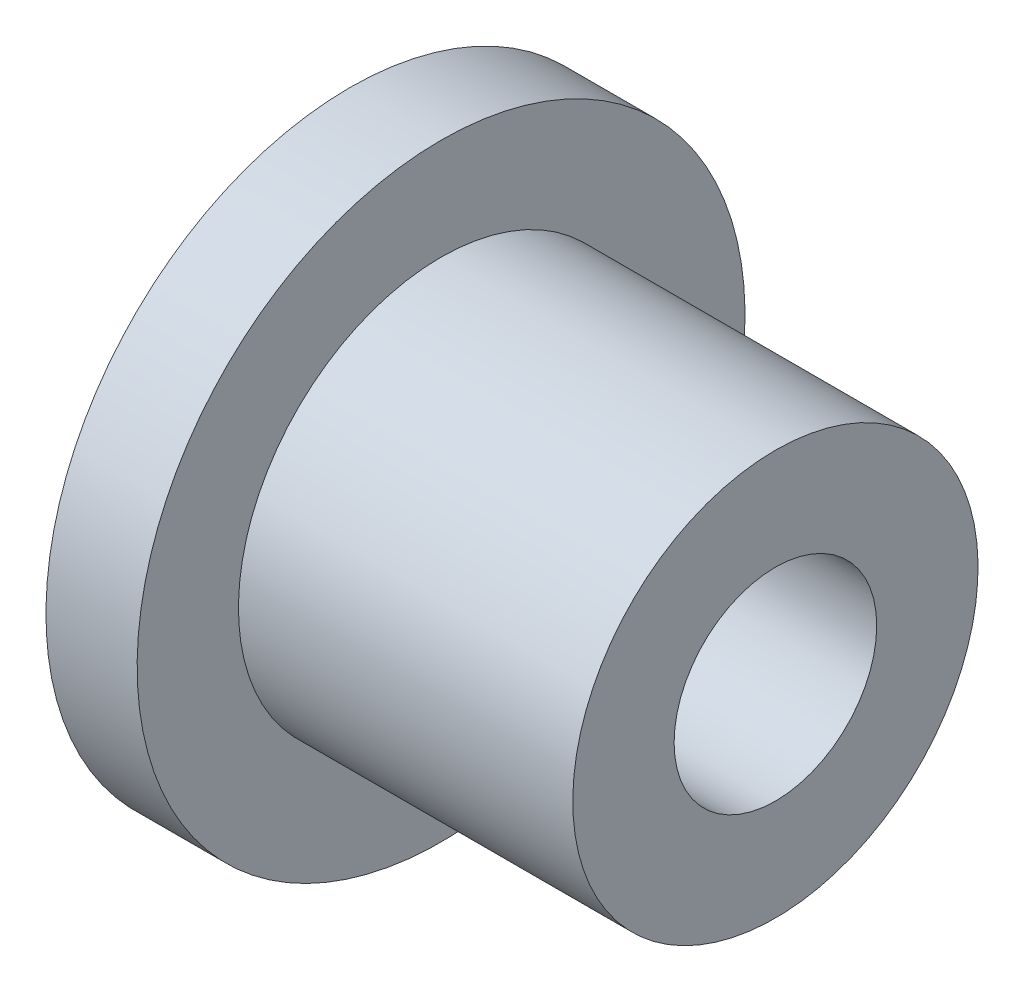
ISO-10303-21;
HEADER;
FILE_DESCRIPTION(('STEP AP214'),'2;1');
FILE_NAME('part.step','',(''),(''),'','','');
FILE_SCHEMA(('AUTOMOTIVE_DESIGN { 1 0 10303 214 1 1 1 1 }'));
ENDSEC;
DATA;
#1=APPLICATION_CONTEXT('core data for automotive mechanical design processes');
#2=APPLICATION_PROTOCOL_DEFINITION('international standard','automotive_design',2000,#1);
#3=PRODUCT_CONTEXT('',#1,'mechanical');
#4=PRODUCT('Part','Part','',(#3));
#5=PRODUCT_RELATED_PRODUCT_CATEGORY('part','',(#4));
#6=PRODUCT_DEFINITION_FORMATION('','',#4);
#7=PRODUCT_DEFINITION_CONTEXT('part definition',#1,'design');
#8=PRODUCT_DEFINITION('design','',#6,#7);
#9=PRODUCT_DEFINITION_SHAPE('','',#8);
#10=(LENGTH_UNIT() NAMED_UNIT(*) SI_UNIT(.MILLI.,.METRE.));
#11=(NAMED_UNIT(*) PLANE_ANGLE_UNIT() SI_UNIT($,.RADIAN.));
#12=(NAMED_UNIT(*) SI_UNIT($,.STERADIAN.) SOLID_ANGLE_UNIT());
#13=UNCERTAINTY_MEASURE_WITH_UNIT(LENGTH_MEASURE(1.E-05),#10,'distance_accuracy_value','');
#14=(GEOMETRIC_REPRESENTATION_CONTEXT(3) GLOBAL_UNCERTAINTY_ASSIGNED_CONTEXT((#13)) GLOBAL_UNIT_ASSIGNED_CONTEXT((#10,
#11,#12)) REPRESENTATION_CONTEXT('',''));
#15=CARTESIAN_POINT('',(0.,0.,0.));
#16=DIRECTION('',(0.,0.,1.));
#17=DIRECTION('',(1.,0.,0.));
#18=AXIS2_PLACEMENT_3D('',#15,#16,#17);
#19=CARTESIAN_POINT('',(12.75,0.,0.));
#20=DIRECTION('',(1.,0.,0.));
#21=DIRECTION('',(0.,1.,0.));
#22=AXIS2_PLACEMENT_3D('',#19,#20,#21);
#23=CYLINDRICAL_SURFACE('',#22,10.);
#24=CARTESIAN_POINT('',(21.,0.,0.));
#25=DIRECTION('',(1.,0.,0.));
#26=DIRECTION('',(0.,1.,0.));
#27=AXIS2_PLACEMENT_3D('',#24,#25,#26);
#28=CIRCLE('',#27,10.);
#29=CARTESIAN_POINT('',(21.,10.,0.));
#30=VERTEX_POINT('',#29);
#31=EDGE_CURVE('E37',#30,#30,#28,.T.);
#32=ORIENTED_EDGE('',*,*,#31,.F.);
#33=EDGE_LOOP('',(#32));
#34=FACE_BOUND('',#33,.T.);
#35=CARTESIAN_POINT('',(4.5,0.,0.));
#36=DIRECTION('',(1.,0.,0.));
#37=DIRECTION('',(0.,1.,0.));
#38=AXIS2_PLACEMENT_3D('',#35,#36,#37);
#39=CIRCLE('',#38,10.);
#40=CARTESIAN_POINT('',(4.5,10.,0.));
#41=VERTEX_POINT('',#40);
#42=EDGE_CURVE('E21',#41,#41,#39,.F.);
#43=ORIENTED_EDGE('',*,*,#42,.F.);
#44=EDGE_LOOP('',(#43));
#45=FACE_BOUND('',#44,.T.);
#46=ADVANCED_FACE('F17',(#34,#45),#23,.T.);
#47=CARTESIAN_POINT('',(4.5,12.5,0.));
#48=DIRECTION('',(1.,0.,0.));
#49=DIRECTION('',(0.,0.,-1.));
#50=AXIS2_PLACEMENT_3D('',#47,#48,#49);
#51=PLANE('',#50);
#52=CARTESIAN_POINT('',(4.5,0.,0.));
#53=DIRECTION('',(1.,0.,0.));
#54=DIRECTION('',(0.,1.,0.));
#55=AXIS2_PLACEMENT_3D('',#52,#53,#54);
#56=CIRCLE('',#55,15.);
#57=CARTESIAN_POINT('',(4.5,15.,0.));
#58=VERTEX_POINT('',#57);
#59=EDGE_CURVE('E35',#58,#58,#56,.F.);
#60=ORIENTED_EDGE('',*,*,#59,.F.);
#61=EDGE_LOOP('',(#60));
#62=FACE_BOUND('',#61,.T.);
#63=ORIENTED_EDGE('',*,*,#42,.T.);
#64=EDGE_LOOP('',(#63));
#65=FACE_BOUND('',#64,.T.);
#66=ADVANCED_FACE('F44',(#62,#65),#51,.T.);
#67=CARTESIAN_POINT('',(21.,7.50000000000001,0.));
#68=DIRECTION('',(1.,0.,0.));
#69=DIRECTION('',(0.,0.,-1.));
#70=AXIS2_PLACEMENT_3D('',#67,#68,#69);
#71=PLANE('',#70);
#72=ORIENTED_EDGE('',*,*,#31,.T.);
#73=EDGE_LOOP('',(#72));
#74=FACE_BOUND('',#73,.T.);
#75=CARTESIAN_POINT('',(21.,0.,0.));
#76=DIRECTION('',(1.,0.,0.));
#77=DIRECTION('',(0.,1.,0.));
#78=AXIS2_PLACEMENT_3D('',#75,#76,#77);
#79=CIRCLE('',#78,5.);
#80=CARTESIAN_POINT('',(21.,5.,0.));
#81=VERTEX_POINT('',#80);
#82=EDGE_CURVE('E30',#81,#81,#79,.T.);
#83=ORIENTED_EDGE('',*,*,#82,.F.);
#84=EDGE_LOOP('',(#83));
#85=FACE_BOUND('',#84,.T.);
#86=ADVANCED_FACE('F54',(#74,#85),#71,.T.);
#87=CARTESIAN_POINT('',(2.25,0.,0.));
#88=DIRECTION('',(1.,0.,0.));
#89=DIRECTION('',(0.,1.,0.));
#90=AXIS2_PLACEMENT_3D('',#87,#88,#89);
#91=CYLINDRICAL_SURFACE('',#90,15.);
#92=ORIENTED_EDGE('',*,*,#59,.T.);
#93=EDGE_LOOP('',(#92));
#94=FACE_BOUND('',#93,.T.);
#95=CARTESIAN_POINT('',(0.,0.,0.));
#96=DIRECTION('',(1.,0.,0.));
#97=DIRECTION('',(0.,1.,0.));
#98=AXIS2_PLACEMENT_3D('',#95,#96,#97);
#99=CIRCLE('',#98,15.);
#100=CARTESIAN_POINT('',(0.,15.,0.));
#101=VERTEX_POINT('',#100);
#102=EDGE_CURVE('E25',#101,#101,#99,.F.);
#103=ORIENTED_EDGE('',*,*,#102,.F.);
#104=EDGE_LOOP('',(#103));
#105=FACE_BOUND('',#104,.T.);
#106=ADVANCED_FACE('F63',(#94,#105),#91,.T.);
#107=CARTESIAN_POINT('',(0.,0.,0.));
#108=DIRECTION('',(1.,0.,0.));
#109=DIRECTION('',(0.,1.,0.));
#110=AXIS2_PLACEMENT_3D('',#107,#108,#109);
#111=CYLINDRICAL_SURFACE('',#110,5.);
#112=CARTESIAN_POINT('',(0.,0.,0.));
#113=DIRECTION('',(1.,0.,0.));
#114=DIRECTION('',(0.,1.,0.));
#115=AXIS2_PLACEMENT_3D('',#112,#113,#114);
#116=CIRCLE('',#115,5.);
#117=CARTESIAN_POINT('',(0.,5.,0.));
#118=VERTEX_POINT('',#117);
#119=EDGE_CURVE('E10',#118,#118,#116,.T.);
#120=ORIENTED_EDGE('',*,*,#119,.F.);
#121=EDGE_LOOP('',(#120));
#122=FACE_BOUND('',#121,.T.);
#123=ORIENTED_EDGE('',*,*,#82,.T.);
#124=EDGE_LOOP('',(#123));
#125=FACE_BOUND('',#124,.T.);
#126=ADVANCED_FACE('F58',(#122,#125),#111,.F.);
#127=CARTESIAN_POINT('',(0.,10.,0.));
#128=DIRECTION('',(-1.,0.,0.));
#129=DIRECTION('',(0.,-1.,0.));
#130=AXIS2_PLACEMENT_3D('',#127,#128,#129);
#131=PLANE('',#130);
#132=ORIENTED_EDGE('',*,*,#119,.T.);
#133=EDGE_LOOP('',(#132));
#134=FACE_BOUND('',#133,.T.);
#135=ORIENTED_EDGE('',*,*,#102,.T.);
#136=EDGE_LOOP('',(#135));
#137=FACE_BOUND('',#136,.T.);
#138=ADVANCED_FACE('F19',(#134,#137),#131,.T.);
#139=CLOSED_SHELL('',(#46,#66,#86,#106,#126,#138));
#140=MANIFOLD_SOLID_BREP('B1',#139);
#141=ADVANCED_BREP_SHAPE_REPRESENTATION('',(#18,#140),#14);
#142=SHAPE_DEFINITION_REPRESENTATION(#9,#141);
ENDSEC;
END-ISO-10303-21;
